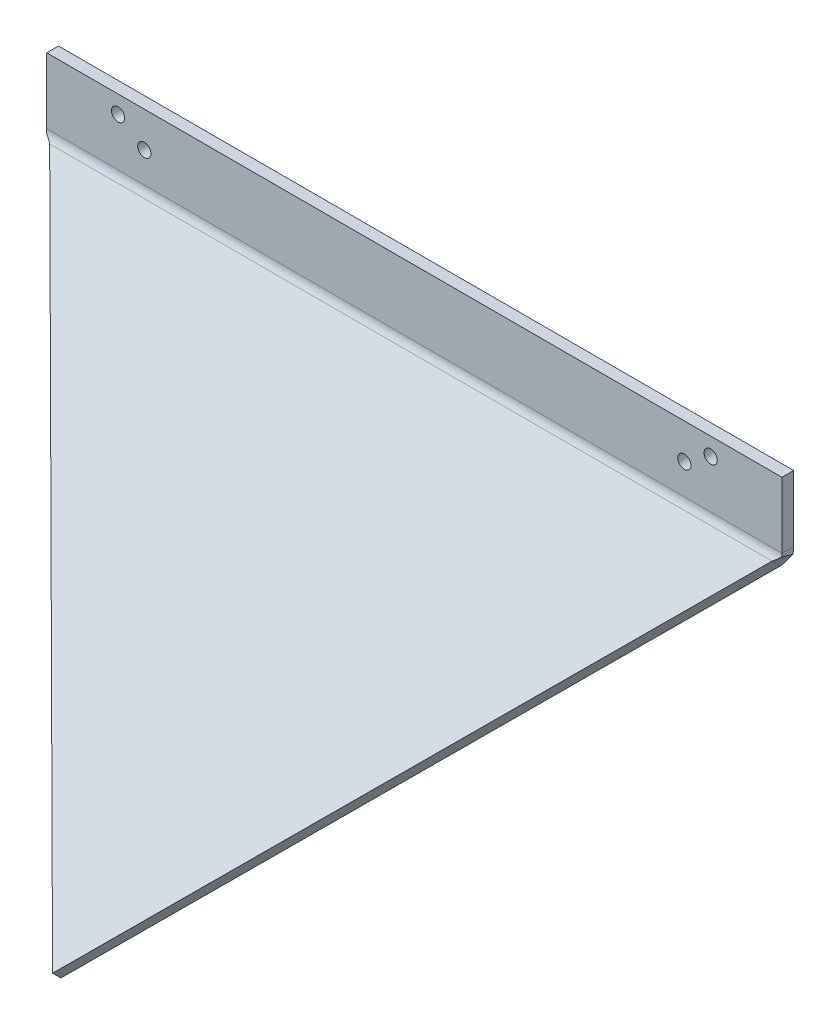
ISO-10303-21;
HEADER;
FILE_DESCRIPTION(('STEP AP214'),'2;1');
FILE_NAME('part.step','',(''),(''),'','','');
FILE_SCHEMA(('AUTOMOTIVE_DESIGN { 1 0 10303 214 1 1 1 1 }'));
ENDSEC;
DATA;
#1=APPLICATION_CONTEXT('core data for automotive mechanical design processes');
#2=APPLICATION_PROTOCOL_DEFINITION('international standard','automotive_design',2000,#1);
#3=PRODUCT_CONTEXT('',#1,'mechanical');
#4=PRODUCT('Part','Part','',(#3));
#5=PRODUCT_RELATED_PRODUCT_CATEGORY('part','',(#4));
#6=PRODUCT_DEFINITION_FORMATION('','',#4);
#7=PRODUCT_DEFINITION_CONTEXT('part definition',#1,'design');
#8=PRODUCT_DEFINITION('design','',#6,#7);
#9=PRODUCT_DEFINITION_SHAPE('','',#8);
#10=(LENGTH_UNIT() NAMED_UNIT(*) SI_UNIT(.MILLI.,.METRE.));
#11=(NAMED_UNIT(*) PLANE_ANGLE_UNIT() SI_UNIT($,.RADIAN.));
#12=(NAMED_UNIT(*) SI_UNIT($,.STERADIAN.) SOLID_ANGLE_UNIT());
#13=UNCERTAINTY_MEASURE_WITH_UNIT(LENGTH_MEASURE(1.E-05),#10,'distance_accuracy_value','');
#14=(GEOMETRIC_REPRESENTATION_CONTEXT(3) GLOBAL_UNCERTAINTY_ASSIGNED_CONTEXT((#13)) GLOBAL_UNIT_ASSIGNED_CONTEXT((#10,
#11,#12)) REPRESENTATION_CONTEXT('',''));
#15=CARTESIAN_POINT('',(0.,0.,0.));
#16=DIRECTION('',(0.,0.,1.));
#17=DIRECTION('',(1.,0.,0.));
#18=AXIS2_PLACEMENT_3D('',#15,#16,#17);
#19=CARTESIAN_POINT('',(0.,0.,0.));
#20=DIRECTION('',(0.,0.,1.));
#21=DIRECTION('',(1.,0.,0.));
#22=AXIS2_PLACEMENT_3D('',#19,#20,#21);
#23=PLANE('',#22);
#24=DIRECTION('',(0.,1.,0.));
#25=VECTOR('',#24,1.);
#26=CARTESIAN_POINT('',(396.875,556.77562,0.));
#27=LINE('',#26,#25);
#28=CARTESIAN_POINT('',(396.875,562.036132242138,0.));
#29=VERTEX_POINT('',#28);
#30=CARTESIAN_POINT('',(396.875,632.97562,0.));
#31=VERTEX_POINT('',#30);
#32=EDGE_CURVE('E105',#29,#31,#27,.T.);
#33=ORIENTED_EDGE('',*,*,#32,.F.);
#34=DIRECTION('',(-1.,0.,0.));
#35=VECTOR('',#34,1.);
#36=CARTESIAN_POINT('',(0.,562.036132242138,0.));
#37=LINE('',#36,#35);
#38=CARTESIAN_POINT('',(-396.875,562.036132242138,0.));
#39=VERTEX_POINT('',#38);
#40=EDGE_CURVE('E64',#29,#39,#37,.T.);
#41=ORIENTED_EDGE('',*,*,#40,.T.);
#42=DIRECTION('',(0.,-1.,0.));
#43=VECTOR('',#42,1.);
#44=CARTESIAN_POINT('',(-396.875,632.97562,0.));
#45=LINE('',#44,#43);
#46=CARTESIAN_POINT('',(-396.875,632.97562,0.));
#47=VERTEX_POINT('',#46);
#48=EDGE_CURVE('E104',#47,#39,#45,.T.);
#49=ORIENTED_EDGE('',*,*,#48,.F.);
#50=DIRECTION('',(-1.,0.,0.));
#51=VECTOR('',#50,1.);
#52=CARTESIAN_POINT('',(396.875,632.97562,0.));
#53=LINE('',#52,#51);
#54=EDGE_CURVE('E94',#31,#47,#53,.T.);
#55=ORIENTED_EDGE('',*,*,#54,.F.);
#56=EDGE_LOOP('',(#33,#41,#49,#55));
#57=FACE_BOUND('',#56,.T.);
#58=CARTESIAN_POINT('',(-319.868351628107,613.92562,0.));
#59=DIRECTION('',(0.,0.,-1.));
#60=DIRECTION('',(-1.,0.,0.));
#61=AXIS2_PLACEMENT_3D('',#58,#59,#60);
#62=CIRCLE('',#61,7.14375);
#63=CARTESIAN_POINT('',(-327.012101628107,613.92562,0.));
#64=VERTEX_POINT('',#63);
#65=EDGE_CURVE('E194',#64,#64,#62,.T.);
#66=ORIENTED_EDGE('',*,*,#65,.F.);
#67=EDGE_LOOP('',(#66));
#68=FACE_BOUND('',#67,.T.);
#69=CARTESIAN_POINT('',(-291.483024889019,594.87562,0.));
#70=DIRECTION('',(0.,0.,-1.));
#71=DIRECTION('',(-1.,0.,0.));
#72=AXIS2_PLACEMENT_3D('',#69,#70,#71);
#73=CIRCLE('',#72,7.14375);
#74=CARTESIAN_POINT('',(-298.626774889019,594.87562,0.));
#75=VERTEX_POINT('',#74);
#76=EDGE_CURVE('E197',#75,#75,#73,.T.);
#77=ORIENTED_EDGE('',*,*,#76,.F.);
#78=EDGE_LOOP('',(#77));
#79=FACE_BOUND('',#78,.T.);
#80=CARTESIAN_POINT('',(319.868351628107,613.92562,0.));
#81=DIRECTION('',(0.,0.,-1.));
#82=DIRECTION('',(-1.,0.,0.));
#83=AXIS2_PLACEMENT_3D('',#80,#81,#82);
#84=CIRCLE('',#83,7.14375);
#85=CARTESIAN_POINT('',(312.724601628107,613.92562,0.));
#86=VERTEX_POINT('',#85);
#87=EDGE_CURVE('E200',#86,#86,#84,.T.);
#88=ORIENTED_EDGE('',*,*,#87,.F.);
#89=EDGE_LOOP('',(#88));
#90=FACE_BOUND('',#89,.T.);
#91=CARTESIAN_POINT('',(291.483024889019,594.87562,0.));
#92=DIRECTION('',(0.,0.,-1.));
#93=DIRECTION('',(-1.,0.,0.));
#94=AXIS2_PLACEMENT_3D('',#91,#92,#93);
#95=CIRCLE('',#94,7.14375);
#96=CARTESIAN_POINT('',(284.339274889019,594.87562,0.));
#97=VERTEX_POINT('',#96);
#98=EDGE_CURVE('E210',#97,#97,#95,.T.);
#99=ORIENTED_EDGE('',*,*,#98,.F.);
#100=EDGE_LOOP('',(#99));
#101=FACE_BOUND('',#100,.T.);
#102=ADVANCED_FACE('F56',(#57,#68,#79,#90,#101),#23,.F.);
#103=CARTESIAN_POINT('',(-396.875,632.97562,12.7));
#104=DIRECTION('',(1.,0.,0.));
#105=DIRECTION('',(0.,0.,-1.));
#106=AXIS2_PLACEMENT_3D('',#103,#104,#105);
#107=PLANE('',#106);
#108=ORIENTED_EDGE('',*,*,#48,.T.);
#109=DIRECTION('',(0.,0.,1.));
#110=VECTOR('',#109,1.);
#111=CARTESIAN_POINT('',(-396.875,562.036132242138,12.6999999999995));
#112=LINE('',#111,#110);
#113=CARTESIAN_POINT('',(-396.875,562.036132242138,12.7));
#114=VERTEX_POINT('',#113);
#115=EDGE_CURVE('E364',#39,#114,#112,.T.);
#116=ORIENTED_EDGE('',*,*,#115,.T.);
#117=DIRECTION('',(0.,-1.,0.));
#118=VECTOR('',#117,1.);
#119=CARTESIAN_POINT('',(-396.875,632.97562,12.7));
#120=LINE('',#119,#118);
#121=CARTESIAN_POINT('',(-396.875,632.97562,12.7));
#122=VERTEX_POINT('',#121);
#123=EDGE_CURVE('E113',#122,#114,#120,.T.);
#124=ORIENTED_EDGE('',*,*,#123,.F.);
#125=DIRECTION('',(0.,0.,-1.));
#126=VECTOR('',#125,1.);
#127=CARTESIAN_POINT('',(-396.875,632.97562,12.7));
#128=LINE('',#127,#126);
#129=EDGE_CURVE('E97',#122,#47,#128,.T.);
#130=ORIENTED_EDGE('',*,*,#129,.T.);
#131=EDGE_LOOP('',(#108,#116,#124,#130));
#132=FACE_BOUND('',#131,.T.);
#133=ADVANCED_FACE('F109',(#132),#107,.F.);
#134=CARTESIAN_POINT('',(396.875,556.77562,12.7));
#135=DIRECTION('',(-1.,0.,0.));
#136=DIRECTION('',(0.,-1.,0.));
#137=AXIS2_PLACEMENT_3D('',#134,#135,#136);
#138=PLANE('',#137);
#139=DIRECTION('',(0.,1.,0.));
#140=VECTOR('',#139,1.);
#141=CARTESIAN_POINT('',(396.875,556.77562,12.7));
#142=LINE('',#141,#140);
#143=CARTESIAN_POINT('',(396.875,562.036132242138,12.7));
#144=VERTEX_POINT('',#143);
#145=CARTESIAN_POINT('',(396.875,632.97562,12.7));
#146=VERTEX_POINT('',#145);
#147=EDGE_CURVE('E116',#144,#146,#142,.T.);
#148=ORIENTED_EDGE('',*,*,#147,.F.);
#149=DIRECTION('',(0.,0.,-1.));
#150=VECTOR('',#149,1.);
#151=CARTESIAN_POINT('',(396.875,562.036132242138,12.7));
#152=LINE('',#151,#150);
#153=EDGE_CURVE('E12',#144,#29,#152,.T.);
#154=ORIENTED_EDGE('',*,*,#153,.T.);
#155=ORIENTED_EDGE('',*,*,#32,.T.);
#156=DIRECTION('',(0.,0.,-1.));
#157=VECTOR('',#156,1.);
#158=CARTESIAN_POINT('',(396.875,632.97562,12.7));
#159=LINE('',#158,#157);
#160=EDGE_CURVE('E100',#146,#31,#159,.T.);
#161=ORIENTED_EDGE('',*,*,#160,.F.);
#162=EDGE_LOOP('',(#148,#154,#155,#161));
#163=FACE_BOUND('',#162,.T.);
#164=ADVANCED_FACE('F440',(#163),#138,.F.);
#165=CARTESIAN_POINT('',(396.875,632.97562,12.7));
#166=DIRECTION('',(0.,-1.,0.));
#167=DIRECTION('',(0.,0.,-1.));
#168=AXIS2_PLACEMENT_3D('',#165,#166,#167);
#169=PLANE('',#168);
#170=ORIENTED_EDGE('',*,*,#54,.T.);
#171=ORIENTED_EDGE('',*,*,#129,.F.);
#172=DIRECTION('',(-1.,0.,0.));
#173=VECTOR('',#172,1.);
#174=CARTESIAN_POINT('',(396.875,632.97562,12.7));
#175=LINE('',#174,#173);
#176=EDGE_CURVE('E81',#146,#122,#175,.T.);
#177=ORIENTED_EDGE('',*,*,#176,.F.);
#178=ORIENTED_EDGE('',*,*,#160,.T.);
#179=EDGE_LOOP('',(#170,#171,#177,#178));
#180=FACE_BOUND('',#179,.T.);
#181=ADVANCED_FACE('F96',(#180),#169,.F.);
#182=CARTESIAN_POINT('',(0.,0.,12.7));
#183=DIRECTION('',(0.,0.,1.));
#184=DIRECTION('',(1.,0.,0.));
#185=AXIS2_PLACEMENT_3D('',#182,#183,#184);
#186=PLANE('',#185);
#187=CARTESIAN_POINT('',(291.483024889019,594.87562,12.7));
#188=DIRECTION('',(0.,0.,1.));
#189=DIRECTION('',(1.,0.,0.));
#190=AXIS2_PLACEMENT_3D('',#187,#188,#189);
#191=CIRCLE('',#190,7.14375);
#192=CARTESIAN_POINT('',(298.626774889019,594.87562,12.7));
#193=VERTEX_POINT('',#192);
#194=EDGE_CURVE('E59',#193,#193,#191,.T.);
#195=ORIENTED_EDGE('',*,*,#194,.F.);
#196=EDGE_LOOP('',(#195));
#197=FACE_BOUND('',#196,.T.);
#198=CARTESIAN_POINT('',(319.868351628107,613.92562,12.7));
#199=DIRECTION('',(0.,0.,1.));
#200=DIRECTION('',(1.,0.,0.));
#201=AXIS2_PLACEMENT_3D('',#198,#199,#200);
#202=CIRCLE('',#201,7.14375);
#203=CARTESIAN_POINT('',(327.012101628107,613.92562,12.7));
#204=VERTEX_POINT('',#203);
#205=EDGE_CURVE('E198',#204,#204,#202,.T.);
#206=ORIENTED_EDGE('',*,*,#205,.F.);
#207=EDGE_LOOP('',(#206));
#208=FACE_BOUND('',#207,.T.);
#209=CARTESIAN_POINT('',(-291.483024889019,594.87562,12.7));
#210=DIRECTION('',(0.,0.,1.));
#211=DIRECTION('',(1.,0.,0.));
#212=AXIS2_PLACEMENT_3D('',#209,#210,#211);
#213=CIRCLE('',#212,7.14375);
#214=CARTESIAN_POINT('',(-284.339274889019,594.87562,12.7));
#215=VERTEX_POINT('',#214);
#216=EDGE_CURVE('E195',#215,#215,#213,.T.);
#217=ORIENTED_EDGE('',*,*,#216,.F.);
#218=EDGE_LOOP('',(#217));
#219=FACE_BOUND('',#218,.T.);
#220=CARTESIAN_POINT('',(-319.868351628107,613.92562,12.7));
#221=DIRECTION('',(0.,0.,1.));
#222=DIRECTION('',(1.,0.,0.));
#223=AXIS2_PLACEMENT_3D('',#220,#221,#222);
#224=CIRCLE('',#223,7.14375);
#225=CARTESIAN_POINT('',(-312.724601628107,613.92562,12.7));
#226=VERTEX_POINT('',#225);
#227=EDGE_CURVE('E185',#226,#226,#224,.T.);
#228=ORIENTED_EDGE('',*,*,#227,.F.);
#229=EDGE_LOOP('',(#228));
#230=FACE_BOUND('',#229,.T.);
#231=DIRECTION('',(-1.,0.,0.));
#232=VECTOR('',#231,1.);
#233=CARTESIAN_POINT('',(0.,562.036132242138,12.7));
#234=LINE('',#233,#232);
#235=EDGE_CURVE('E361',#144,#114,#234,.T.);
#236=ORIENTED_EDGE('',*,*,#235,.F.);
#237=ORIENTED_EDGE('',*,*,#147,.T.);
#238=ORIENTED_EDGE('',*,*,#176,.T.);
#239=ORIENTED_EDGE('',*,*,#123,.T.);
#240=EDGE_LOOP('',(#236,#237,#238,#239));
#241=FACE_BOUND('',#240,.T.);
#242=ADVANCED_FACE('F441',(#197,#208,#219,#230,#241),#186,.T.);
#243=CARTESIAN_POINT('',(389.959804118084,544.07562,7.43948775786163));
#244=CARTESIAN_POINT('',(392.267681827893,547.12817149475,4.38693626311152));
#245=CARTESIAN_POINT('',(394.567122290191,550.957509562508,2.13929793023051));
#246=CARTESIAN_POINT('',(396.875,555.110918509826,0.962295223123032));
#247=CARTESIAN_POINT('',(389.959804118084,553.055876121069,16.4197438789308));
#248=CARTESIAN_POINT('',(392.26672720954,554.581520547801,14.894099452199));
#249=CARTESIAN_POINT('',(394.568076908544,556.497679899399,13.769405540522));
#250=CARTESIAN_POINT('',(396.875,558.573525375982,13.1811476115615));
#251=B_SPLINE_SURFACE_WITH_KNOTS('',1,3,((#243,#244,#245,#246),(#247,#248,#249,#250)),
.UNSPECIFIED.,.F.,.F.,.F.,(2,2),(4,4),(0.,1.),(0.,1.),.UNSPECIFIED.);
#252=CARTESIAN_POINT('',(389.959804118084,553.055876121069,16.4197438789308));
#253=CARTESIAN_POINT('',(389.959804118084,544.07562,7.43948775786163));
#254=B_SPLINE_CURVE_WITH_KNOTS('',1,(#252,#253),.UNSPECIFIED.,.F.,.F.,(2,2),(0.,1.),.UNSPECIFIED.);
#255=CARTESIAN_POINT('',(389.959804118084,553.055876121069,16.4197438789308));
#256=VERTEX_POINT('',#255);
#257=CARTESIAN_POINT('',(389.959804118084,544.07562,7.43948775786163));
#258=VERTEX_POINT('',#257);
#259=EDGE_CURVE('E193',#256,#258,#254,.T.);
#260=CARTESIAN_POINT('',(389.959804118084,544.07562,7.43948775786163));
#261=CARTESIAN_POINT('',(392.267681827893,547.12817149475,4.38693626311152));
#262=CARTESIAN_POINT('',(394.567122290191,550.957509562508,2.13929793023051));
#263=CARTESIAN_POINT('',(396.875,555.110918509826,0.962295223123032));
#264=B_SPLINE_CURVE_WITH_KNOTS('',3,(#260,#261,#262,#263),.UNSPECIFIED.,.F.,.F.,(4,4),(0.,1.),.UNSPECIFIED.);
#265=CARTESIAN_POINT('',(396.875,555.110918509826,0.962295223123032));
#266=VERTEX_POINT('',#265);
#267=EDGE_CURVE('E221',#258,#266,#264,.T.);
#268=CARTESIAN_POINT('',(396.875,555.110918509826,0.962295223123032));
#269=CARTESIAN_POINT('',(396.875,558.573525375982,13.1811476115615));
#270=B_SPLINE_CURVE_WITH_KNOTS('',1,(#268,#269),.UNSPECIFIED.,.F.,.F.,(2,2),(0.,1.),.UNSPECIFIED.);
#271=CARTESIAN_POINT('',(396.875,558.573525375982,13.1811476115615));
#272=VERTEX_POINT('',#271);
#273=EDGE_CURVE('E411',#266,#272,#270,.T.);
#274=CARTESIAN_POINT('',(396.875,558.573525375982,13.1811476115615));
#275=CARTESIAN_POINT('',(394.568076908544,556.497679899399,13.769405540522));
#276=CARTESIAN_POINT('',(392.26672720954,554.581520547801,14.894099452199));
#277=CARTESIAN_POINT('',(389.959804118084,553.055876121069,16.4197438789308));
#278=B_SPLINE_CURVE_WITH_KNOTS('',3,(#274,#275,#276,#277),.UNSPECIFIED.,.F.,.F.,(4,4),(0.,1.),.UNSPECIFIED.);
#279=EDGE_CURVE('E242',#256,#272,#278,.F.);
#280=ORIENTED_EDGE('',*,*,#259,.T.);
#281=ORIENTED_EDGE('',*,*,#267,.T.);
#282=ORIENTED_EDGE('',*,*,#273,.T.);
#283=ORIENTED_EDGE('',*,*,#279,.F.);
#284=EDGE_LOOP('',(#280,#281,#282,#283));
#285=FACE_BOUND('',#284,.T.);
#286=ADVANCED_FACE('F308',(#285),#251,.F.);
#287=CARTESIAN_POINT('',(396.875,562.036132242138,25.4));
#288=DIRECTION('',(-1.,0.,0.));
#289=DIRECTION('',(0.,0.,1.));
#290=AXIS2_PLACEMENT_3D('',#287,#288,#289);
#291=PLANE('',#290);
#292=ORIENTED_EDGE('',*,*,#273,.F.);
#293=CARTESIAN_POINT('',(396.875,562.036132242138,25.4));
#294=DIRECTION('',(1.,0.,0.));
#295=DIRECTION('',(0.,0.,-1.));
#296=AXIS2_PLACEMENT_3D('',#293,#294,#295);
#297=CIRCLE('',#296,25.4);
#298=EDGE_CURVE('E72',#266,#29,#297,.T.);
#299=ORIENTED_EDGE('',*,*,#298,.T.);
#300=ORIENTED_EDGE('',*,*,#153,.F.);
#301=CARTESIAN_POINT('',(396.875,562.036132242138,25.4));
#302=DIRECTION('',(1.,0.,0.));
#303=DIRECTION('',(0.,0.,-1.));
#304=AXIS2_PLACEMENT_3D('',#301,#302,#303);
#305=CIRCLE('',#304,12.7);
#306=EDGE_CURVE('E227',#272,#144,#305,.T.);
#307=ORIENTED_EDGE('',*,*,#306,.F.);
#308=EDGE_LOOP('',(#292,#299,#300,#307));
#309=FACE_BOUND('',#308,.T.);
#310=ADVANCED_FACE('F437',(#309),#291,.F.);
#311=CARTESIAN_POINT('',(-396.875,562.036132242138,25.4));
#312=DIRECTION('',(1.,0.,0.));
#313=DIRECTION('',(0.,0.,-1.));
#314=AXIS2_PLACEMENT_3D('',#311,#312,#313);
#315=PLANE('',#314);
#316=ORIENTED_EDGE('',*,*,#115,.F.);
#317=CARTESIAN_POINT('',(-396.875,562.036132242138,25.4));
#318=DIRECTION('',(1.,0.,0.));
#319=DIRECTION('',(0.,0.,-1.));
#320=AXIS2_PLACEMENT_3D('',#317,#318,#319);
#321=CIRCLE('',#320,25.4);
#322=CARTESIAN_POINT('',(-396.875,555.110918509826,0.962295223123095));
#323=VERTEX_POINT('',#322);
#324=EDGE_CURVE('E220',#39,#323,#321,.F.);
#325=ORIENTED_EDGE('',*,*,#324,.T.);
#326=CARTESIAN_POINT('',(-396.875,558.573525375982,13.1811476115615));
#327=CARTESIAN_POINT('',(-396.875,555.110918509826,0.962295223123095));
#328=B_SPLINE_CURVE_WITH_KNOTS('',1,(#326,#327),.UNSPECIFIED.,.F.,.F.,(2,2),(0.,1.),.UNSPECIFIED.);
#329=CARTESIAN_POINT('',(-396.875,558.573525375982,13.1811476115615));
#330=VERTEX_POINT('',#329);
#331=EDGE_CURVE('E340',#323,#330,#328,.F.);
#332=ORIENTED_EDGE('',*,*,#331,.T.);
#333=CARTESIAN_POINT('',(-396.875,562.036132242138,25.4));
#334=DIRECTION('',(-1.,0.,0.));
#335=DIRECTION('',(0.,0.,1.));
#336=AXIS2_PLACEMENT_3D('',#333,#334,#335);
#337=CIRCLE('',#336,12.7);
#338=EDGE_CURVE('E371',#114,#330,#337,.T.);
#339=ORIENTED_EDGE('',*,*,#338,.F.);
#340=EDGE_LOOP('',(#316,#325,#332,#339));
#341=FACE_BOUND('',#340,.T.);
#342=ADVANCED_FACE('F264',(#341),#315,.F.);
#343=CARTESIAN_POINT('',(-396.875,555.110918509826,0.962295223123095));
#344=CARTESIAN_POINT('',(-394.567122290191,550.957509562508,2.13929793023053));
#345=CARTESIAN_POINT('',(-392.267681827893,547.12817149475,4.3869362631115));
#346=CARTESIAN_POINT('',(-389.959804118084,544.07562,7.43948775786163));
#347=CARTESIAN_POINT('',(-396.875,558.573525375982,13.1811476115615));
#348=CARTESIAN_POINT('',(-394.568076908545,556.497679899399,13.7694055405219));
#349=CARTESIAN_POINT('',(-392.266727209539,554.581520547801,14.8940994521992));
#350=CARTESIAN_POINT('',(-389.959804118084,553.055876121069,16.4197438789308));
#351=B_SPLINE_SURFACE_WITH_KNOTS('',1,3,((#343,#344,#345,#346),(#347,#348,#349,#350)),
.UNSPECIFIED.,.F.,.F.,.F.,(2,2),(4,4),(0.,1.),(0.,1.),.UNSPECIFIED.);
#352=CARTESIAN_POINT('',(-396.875,555.110918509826,0.962295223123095));
#353=CARTESIAN_POINT('',(-394.567122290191,550.957509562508,2.13929793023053));
#354=CARTESIAN_POINT('',(-392.267681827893,547.12817149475,4.3869362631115));
#355=CARTESIAN_POINT('',(-389.959804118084,544.07562,7.43948775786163));
#356=B_SPLINE_CURVE_WITH_KNOTS('',3,(#352,#353,#354,#355),.UNSPECIFIED.,.F.,.F.,(4,4),(0.,1.),.UNSPECIFIED.);
#357=CARTESIAN_POINT('',(-389.959804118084,544.07562,7.43948775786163));
#358=VERTEX_POINT('',#357);
#359=EDGE_CURVE('E282',#323,#358,#356,.T.);
#360=CARTESIAN_POINT('',(-389.959804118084,544.07562,7.43948775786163));
#361=CARTESIAN_POINT('',(-389.959804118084,553.055876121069,16.4197438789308));
#362=B_SPLINE_CURVE_WITH_KNOTS('',1,(#360,#361),.UNSPECIFIED.,.F.,.F.,(2,2),(0.,1.),.UNSPECIFIED.);
#363=CARTESIAN_POINT('',(-389.959804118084,553.055876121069,16.4197438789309));
#364=VERTEX_POINT('',#363);
#365=EDGE_CURVE('E126',#358,#364,#362,.T.);
#366=CARTESIAN_POINT('',(-389.959804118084,553.055876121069,16.4197438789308));
#367=CARTESIAN_POINT('',(-392.266727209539,554.581520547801,14.8940994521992));
#368=CARTESIAN_POINT('',(-394.568076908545,556.497679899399,13.7694055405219));
#369=CARTESIAN_POINT('',(-396.875,558.573525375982,13.1811476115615));
#370=B_SPLINE_CURVE_WITH_KNOTS('',3,(#366,#367,#368,#369),.UNSPECIFIED.,.F.,.F.,(4,4),(0.,1.),.UNSPECIFIED.);
#371=EDGE_CURVE('E290',#330,#364,#370,.F.);
#372=ORIENTED_EDGE('',*,*,#359,.T.);
#373=ORIENTED_EDGE('',*,*,#365,.T.);
#374=ORIENTED_EDGE('',*,*,#371,.F.);
#375=ORIENTED_EDGE('',*,*,#331,.F.);
#376=EDGE_LOOP('',(#372,#373,#374,#375));
#377=FACE_BOUND('',#376,.T.);
#378=ADVANCED_FACE('F263',(#377),#351,.F.);
#379=CARTESIAN_POINT('',(-793.992574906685,562.036132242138,25.4));
#380=DIRECTION('',(1.,0.,0.));
#381=DIRECTION('',(0.,0.,-1.));
#382=AXIS2_PLACEMENT_3D('',#379,#380,#381);
#383=CYLINDRICAL_SURFACE('',#382,12.7);
#384=ORIENTED_EDGE('',*,*,#338,.T.);
#385=ORIENTED_EDGE('',*,*,#371,.T.);
#386=DIRECTION('',(-1.,0.,0.));
#387=VECTOR('',#386,1.);
#388=CARTESIAN_POINT('',(0.,553.055876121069,16.4197438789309));
#389=LINE('',#388,#387);
#390=EDGE_CURVE('E125',#256,#364,#389,.T.);
#391=ORIENTED_EDGE('',*,*,#390,.F.);
#392=ORIENTED_EDGE('',*,*,#279,.T.);
#393=ORIENTED_EDGE('',*,*,#306,.T.);
#394=ORIENTED_EDGE('',*,*,#235,.T.);
#395=EDGE_LOOP('',(#384,#385,#391,#392,#393,#394));
#396=FACE_BOUND('',#395,.T.);
#397=ADVANCED_FACE('F175',(#396),#383,.F.);
#398=CARTESIAN_POINT('',(-793.992574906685,562.036132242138,25.4));
#399=DIRECTION('',(1.,0.,0.));
#400=DIRECTION('',(0.,0.,-1.));
#401=AXIS2_PLACEMENT_3D('',#398,#399,#400);
#402=CYLINDRICAL_SURFACE('',#401,25.4);
#403=ORIENTED_EDGE('',*,*,#324,.F.);
#404=ORIENTED_EDGE('',*,*,#40,.F.);
#405=ORIENTED_EDGE('',*,*,#298,.F.);
#406=ORIENTED_EDGE('',*,*,#267,.F.);
#407=DIRECTION('',(-1.,0.,0.));
#408=VECTOR('',#407,1.);
#409=CARTESIAN_POINT('',(0.,544.07562,7.43948775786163));
#410=LINE('',#409,#408);
#411=EDGE_CURVE('E151',#258,#358,#410,.T.);
#412=ORIENTED_EDGE('',*,*,#411,.T.);
#413=ORIENTED_EDGE('',*,*,#359,.F.);
#414=EDGE_LOOP('',(#403,#404,#405,#406,#412,#413));
#415=FACE_BOUND('',#414,.T.);
#416=ADVANCED_FACE('F254',(#415),#402,.T.);
#417=CARTESIAN_POINT('',(0.,166.215930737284,403.259689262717));
#418=DIRECTION('',(0.,0.707106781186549,0.707106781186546));
#419=DIRECTION('',(1.,0.,0.));
#420=AXIS2_PLACEMENT_3D('',#417,#418,#419);
#421=PLANE('',#420);
#422=DIRECTION('',(0.580441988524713,0.575798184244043,-0.575798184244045));
#423=VECTOR('',#422,1.);
#424=CARTESIAN_POINT('',(0.,166.215930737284,403.259689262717));
#425=LINE('',#424,#423);
#426=CARTESIAN_POINT('',(0.,166.215930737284,403.259689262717));
#427=VERTEX_POINT('',#426);
#428=EDGE_CURVE('E122',#427,#256,#425,.T.);
#429=ORIENTED_EDGE('',*,*,#428,.T.);
#430=ORIENTED_EDGE('',*,*,#390,.T.);
#431=DIRECTION('',(0.580441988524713,-0.575798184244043,0.575798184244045));
#432=VECTOR('',#431,1.);
#433=CARTESIAN_POINT('',(0.,166.215930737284,403.259689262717));
#434=LINE('',#433,#432);
#435=EDGE_CURVE('E131',#364,#427,#434,.T.);
#436=ORIENTED_EDGE('',*,*,#435,.T.);
#437=EDGE_LOOP('',(#429,#430,#436));
#438=FACE_BOUND('',#437,.T.);
#439=ADVANCED_FACE('F164',(#438),#421,.T.);
#440=CARTESIAN_POINT('',(0.,166.215930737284,403.259689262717));
#441=DIRECTION('',(0.814301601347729,0.410434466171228,-0.41043446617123));
#442=DIRECTION('',(-0.580441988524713,0.575798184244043,-0.575798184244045));
#443=AXIS2_PLACEMENT_3D('',#440,#441,#442);
#444=PLANE('',#443);
#445=ORIENTED_EDGE('',*,*,#365,.F.);
#446=DIRECTION('',(0.580441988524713,-0.575798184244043,0.575798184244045));
#447=VECTOR('',#446,1.);
#448=CARTESIAN_POINT('',(0.,157.235674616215,394.279433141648));
#449=LINE('',#448,#447);
#450=CARTESIAN_POINT('',(0.,157.235674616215,394.279433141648));
#451=VERTEX_POINT('',#450);
#452=EDGE_CURVE('E136',#358,#451,#449,.T.);
#453=ORIENTED_EDGE('',*,*,#452,.T.);
#454=DIRECTION('',(0.,-0.707106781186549,-0.707106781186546));
#455=VECTOR('',#454,1.);
#456=CARTESIAN_POINT('',(0.,166.215930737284,403.259689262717));
#457=LINE('',#456,#455);
#458=EDGE_CURVE('E215',#427,#451,#457,.T.);
#459=ORIENTED_EDGE('',*,*,#458,.F.);
#460=ORIENTED_EDGE('',*,*,#435,.F.);
#461=EDGE_LOOP('',(#445,#453,#459,#460));
#462=FACE_BOUND('',#461,.T.);
#463=ADVANCED_FACE('F153',(#462),#444,.F.);
#464=CARTESIAN_POINT('',(0.,157.235674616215,394.279433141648));
#465=DIRECTION('',(0.,0.707106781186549,0.707106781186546));
#466=DIRECTION('',(1.,0.,0.));
#467=AXIS2_PLACEMENT_3D('',#464,#465,#466);
#468=PLANE('',#467);
#469=ORIENTED_EDGE('',*,*,#411,.F.);
#470=DIRECTION('',(0.580441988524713,0.575798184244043,-0.575798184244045));
#471=VECTOR('',#470,1.);
#472=CARTESIAN_POINT('',(0.,157.235674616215,394.279433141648));
#473=LINE('',#472,#471);
#474=EDGE_CURVE('E218',#451,#258,#473,.T.);
#475=ORIENTED_EDGE('',*,*,#474,.F.);
#476=ORIENTED_EDGE('',*,*,#452,.F.);
#477=EDGE_LOOP('',(#469,#475,#476));
#478=FACE_BOUND('',#477,.T.);
#479=ADVANCED_FACE('F163',(#478),#468,.F.);
#480=CARTESIAN_POINT('',(0.,166.215930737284,403.259689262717));
#481=DIRECTION('',(-0.814301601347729,0.410434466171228,-0.41043446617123));
#482=DIRECTION('',(-0.580441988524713,-0.575798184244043,0.575798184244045));
#483=AXIS2_PLACEMENT_3D('',#480,#481,#482);
#484=PLANE('',#483);
#485=ORIENTED_EDGE('',*,*,#259,.F.);
#486=ORIENTED_EDGE('',*,*,#428,.F.);
#487=ORIENTED_EDGE('',*,*,#458,.T.);
#488=ORIENTED_EDGE('',*,*,#474,.T.);
#489=EDGE_LOOP('',(#485,#486,#487,#488));
#490=FACE_BOUND('',#489,.T.);
#491=ADVANCED_FACE('F168',(#490),#484,.F.);
#492=CARTESIAN_POINT('',(-319.868351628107,613.92562,0.));
#493=DIRECTION('',(0.,0.,-1.));
#494=DIRECTION('',(-1.,0.,0.));
#495=AXIS2_PLACEMENT_3D('',#492,#493,#494);
#496=CYLINDRICAL_SURFACE('',#495,7.14375);
#497=ORIENTED_EDGE('',*,*,#227,.T.);
#498=EDGE_LOOP('',(#497));
#499=FACE_BOUND('',#498,.T.);
#500=ORIENTED_EDGE('',*,*,#65,.T.);
#501=EDGE_LOOP('',(#500));
#502=FACE_BOUND('',#501,.T.);
#503=ADVANCED_FACE('F173',(#499,#502),#496,.F.);
#504=CARTESIAN_POINT('',(-291.483024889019,594.87562,0.));
#505=DIRECTION('',(0.,0.,-1.));
#506=DIRECTION('',(-1.,0.,0.));
#507=AXIS2_PLACEMENT_3D('',#504,#505,#506);
#508=CYLINDRICAL_SURFACE('',#507,7.14375);
#509=ORIENTED_EDGE('',*,*,#216,.T.);
#510=EDGE_LOOP('',(#509));
#511=FACE_BOUND('',#510,.T.);
#512=ORIENTED_EDGE('',*,*,#76,.T.);
#513=EDGE_LOOP('',(#512));
#514=FACE_BOUND('',#513,.T.);
#515=ADVANCED_FACE('F466',(#511,#514),#508,.F.);
#516=CARTESIAN_POINT('',(319.868351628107,613.92562,0.));
#517=DIRECTION('',(0.,0.,-1.));
#518=DIRECTION('',(-1.,0.,0.));
#519=AXIS2_PLACEMENT_3D('',#516,#517,#518);
#520=CYLINDRICAL_SURFACE('',#519,7.14375);
#521=ORIENTED_EDGE('',*,*,#205,.T.);
#522=EDGE_LOOP('',(#521));
#523=FACE_BOUND('',#522,.T.);
#524=ORIENTED_EDGE('',*,*,#87,.T.);
#525=EDGE_LOOP('',(#524));
#526=FACE_BOUND('',#525,.T.);
#527=ADVANCED_FACE('F477',(#523,#526),#520,.F.);
#528=CARTESIAN_POINT('',(291.483024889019,594.87562,0.));
#529=DIRECTION('',(0.,0.,-1.));
#530=DIRECTION('',(-1.,0.,0.));
#531=AXIS2_PLACEMENT_3D('',#528,#529,#530);
#532=CYLINDRICAL_SURFACE('',#531,7.14375);
#533=ORIENTED_EDGE('',*,*,#194,.T.);
#534=EDGE_LOOP('',(#533));
#535=FACE_BOUND('',#534,.T.);
#536=ORIENTED_EDGE('',*,*,#98,.T.);
#537=EDGE_LOOP('',(#536));
#538=FACE_BOUND('',#537,.T.);
#539=ADVANCED_FACE('F475',(#535,#538),#532,.F.);
#540=CLOSED_SHELL('',(#102,#133,#164,#181,#242,#286,#310,#342,#378,#397,#416,#439,#463,#479,
#491,#503,#515,#527,#539));
#541=MANIFOLD_SOLID_BREP('B2',#540);
#542=ADVANCED_BREP_SHAPE_REPRESENTATION('',(#18,#541),#14);
#543=SHAPE_DEFINITION_REPRESENTATION(#9,#542);
ENDSEC;
END-ISO-10303-21;
